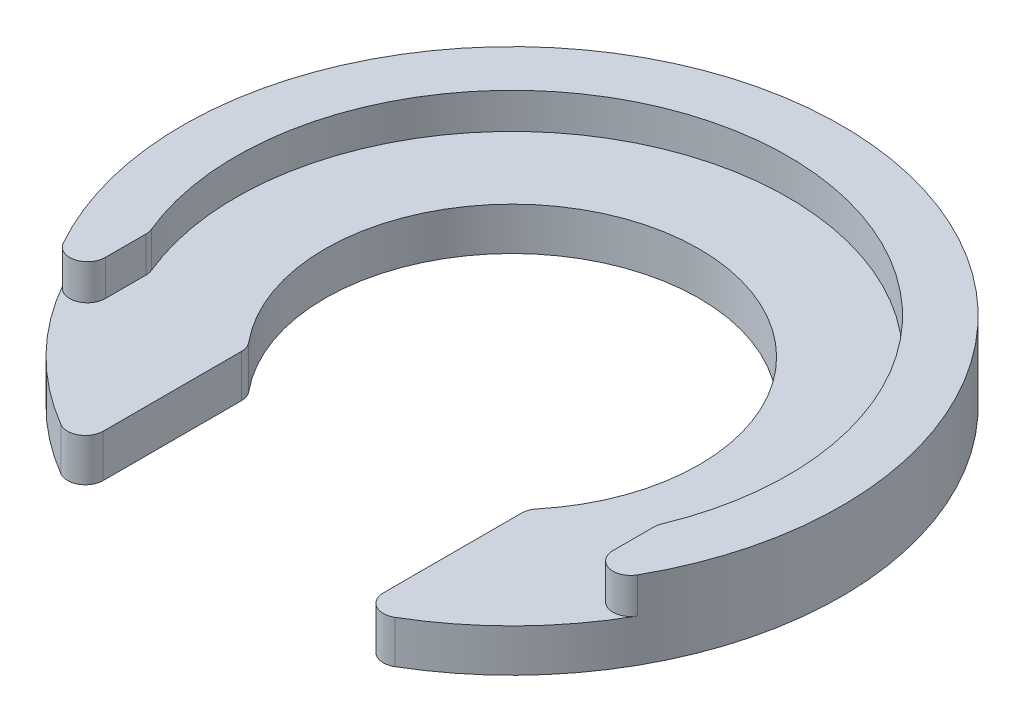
ISO-10303-21;
HEADER;
FILE_DESCRIPTION(('STEP AP214'),'2;1');
FILE_NAME('part.step','',(''),(''),'','','');
FILE_SCHEMA(('AUTOMOTIVE_DESIGN { 1 0 10303 214 1 1 1 1 }'));
ENDSEC;
DATA;
#1=APPLICATION_CONTEXT('core data for automotive mechanical design processes');
#2=APPLICATION_PROTOCOL_DEFINITION('international standard','automotive_design',2000,#1);
#3=PRODUCT_CONTEXT('',#1,'mechanical');
#4=PRODUCT('Part','Part','',(#3));
#5=PRODUCT_RELATED_PRODUCT_CATEGORY('part','',(#4));
#6=PRODUCT_DEFINITION_FORMATION('','',#4);
#7=PRODUCT_DEFINITION_CONTEXT('part definition',#1,'design');
#8=PRODUCT_DEFINITION('design','',#6,#7);
#9=PRODUCT_DEFINITION_SHAPE('','',#8);
#10=(LENGTH_UNIT() NAMED_UNIT(*) SI_UNIT(.MILLI.,.METRE.));
#11=(NAMED_UNIT(*) PLANE_ANGLE_UNIT() SI_UNIT($,.RADIAN.));
#12=(NAMED_UNIT(*) SI_UNIT($,.STERADIAN.) SOLID_ANGLE_UNIT());
#13=UNCERTAINTY_MEASURE_WITH_UNIT(LENGTH_MEASURE(1.E-05),#10,'distance_accuracy_value','');
#14=(GEOMETRIC_REPRESENTATION_CONTEXT(3) GLOBAL_UNCERTAINTY_ASSIGNED_CONTEXT((#13)) GLOBAL_UNIT_ASSIGNED_CONTEXT((#10,
#11,#12)) REPRESENTATION_CONTEXT('',''));
#15=CARTESIAN_POINT('',(0.,0.,0.));
#16=DIRECTION('',(0.,0.,1.));
#17=DIRECTION('',(1.,0.,0.));
#18=AXIS2_PLACEMENT_3D('',#15,#16,#17);
#19=CARTESIAN_POINT('',(0.,0.,0.));
#20=DIRECTION('',(0.,-1.,0.));
#21=DIRECTION('',(0.,0.,-1.));
#22=AXIS2_PLACEMENT_3D('',#19,#20,#21);
#23=CYLINDRICAL_SURFACE('',#22,18.5);
#24=CARTESIAN_POINT('',(0.,2.4,0.));
#25=DIRECTION('',(0.,1.,0.));
#26=DIRECTION('',(0.,0.,1.));
#27=AXIS2_PLACEMENT_3D('',#24,#25,#26);
#28=CIRCLE('',#27,18.5);
#29=CARTESIAN_POINT('',(9.36777121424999,2.4,15.9528951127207));
#30=VERTEX_POINT('',#29);
#31=CARTESIAN_POINT('',(16.1214285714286,2.4,9.07466477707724));
#32=VERTEX_POINT('',#31);
#33=EDGE_CURVE('E251',#30,#32,#28,.T.);
#34=ORIENTED_EDGE('',*,*,#33,.F.);
#35=DIRECTION('',(0.,-1.,0.));
#36=VECTOR('',#35,1.);
#37=CARTESIAN_POINT('',(9.36777121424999,0.,15.9528951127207));
#38=LINE('',#37,#36);
#39=CARTESIAN_POINT('',(9.36777121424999,0.,15.9528951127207));
#40=VERTEX_POINT('',#39);
#41=EDGE_CURVE('E217',#30,#40,#38,.T.);
#42=ORIENTED_EDGE('',*,*,#41,.T.);
#43=CARTESIAN_POINT('',(0.,0.,0.));
#44=DIRECTION('',(0.,-1.,0.));
#45=DIRECTION('',(0.,0.,-1.));
#46=AXIS2_PLACEMENT_3D('',#43,#44,#45);
#47=CIRCLE('',#46,18.5);
#48=CARTESIAN_POINT('',(-9.36777121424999,0.,15.9528951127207));
#49=VERTEX_POINT('',#48);
#50=EDGE_CURVE('E177',#49,#40,#47,.T.);
#51=ORIENTED_EDGE('',*,*,#50,.F.);
#52=DIRECTION('',(0.,-1.,0.));
#53=VECTOR('',#52,1.);
#54=CARTESIAN_POINT('',(-9.36777121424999,0.,15.9528951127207));
#55=LINE('',#54,#53);
#56=CARTESIAN_POINT('',(-9.36777121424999,2.4,15.9528951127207));
#57=VERTEX_POINT('',#56);
#58=EDGE_CURVE('E214',#49,#57,#55,.F.);
#59=ORIENTED_EDGE('',*,*,#58,.T.);
#60=CARTESIAN_POINT('',(-16.1214285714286,2.4,9.07466477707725));
#61=VERTEX_POINT('',#60);
#62=EDGE_CURVE('E313',#61,#57,#28,.T.);
#63=ORIENTED_EDGE('',*,*,#62,.F.);
#64=DIRECTION('',(0.,-1.,0.));
#65=VECTOR('',#64,1.);
#66=CARTESIAN_POINT('',(-16.1214285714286,0.,9.07466477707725));
#67=LINE('',#66,#65);
#68=CARTESIAN_POINT('',(-16.1214285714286,4.4,9.07466477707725));
#69=VERTEX_POINT('',#68);
#70=EDGE_CURVE('E209',#61,#69,#67,.F.);
#71=ORIENTED_EDGE('',*,*,#70,.T.);
#72=CARTESIAN_POINT('',(0.,4.4,0.));
#73=DIRECTION('',(0.,-1.,0.));
#74=DIRECTION('',(0.,0.,-1.));
#75=AXIS2_PLACEMENT_3D('',#72,#73,#74);
#76=CIRCLE('',#75,18.5);
#77=CARTESIAN_POINT('',(16.1214285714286,4.4,9.07466477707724));
#78=VERTEX_POINT('',#77);
#79=EDGE_CURVE('E324',#69,#78,#76,.T.);
#80=ORIENTED_EDGE('',*,*,#79,.T.);
#81=DIRECTION('',(0.,-1.,0.));
#82=VECTOR('',#81,1.);
#83=CARTESIAN_POINT('',(16.1214285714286,0.,9.07466477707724));
#84=LINE('',#83,#82);
#85=EDGE_CURVE('E211',#78,#32,#84,.T.);
#86=ORIENTED_EDGE('',*,*,#85,.T.);
#87=EDGE_LOOP('',(#34,#42,#51,#59,#63,#71,#80,#86));
#88=FACE_BOUND('',#87,.T.);
#89=ADVANCED_FACE('F33',(#88),#23,.T.);
#90=CARTESIAN_POINT('',(0.,0.,0.));
#91=DIRECTION('',(0.,-1.,0.));
#92=DIRECTION('',(0.,0.,-1.));
#93=AXIS2_PLACEMENT_3D('',#90,#91,#92);
#94=CYLINDRICAL_SURFACE('',#93,15.5);
#95=CARTESIAN_POINT('',(0.,4.4,0.));
#96=DIRECTION('',(0.,-1.,0.));
#97=DIRECTION('',(0.,0.,-1.));
#98=AXIS2_PLACEMENT_3D('',#95,#96,#97);
#99=CIRCLE('',#98,15.5);
#100=CARTESIAN_POINT('',(-14.3257575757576,4.4,5.91799542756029));
#101=VERTEX_POINT('',#100);
#102=CARTESIAN_POINT('',(14.3257575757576,4.4,5.91799542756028));
#103=VERTEX_POINT('',#102);
#104=EDGE_CURVE('E327',#101,#103,#99,.T.);
#105=ORIENTED_EDGE('',*,*,#104,.F.);
#106=DIRECTION('',(0.,-1.,0.));
#107=VECTOR('',#106,1.);
#108=CARTESIAN_POINT('',(-14.3257575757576,0.,5.91799542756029));
#109=LINE('',#108,#107);
#110=CARTESIAN_POINT('',(-14.3257575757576,2.4,5.91799542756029));
#111=VERTEX_POINT('',#110);
#112=EDGE_CURVE('E234',#101,#111,#109,.T.);
#113=ORIENTED_EDGE('',*,*,#112,.T.);
#114=CARTESIAN_POINT('',(0.,2.4,0.));
#115=DIRECTION('',(0.,-1.,0.));
#116=DIRECTION('',(0.,0.,-1.));
#117=AXIS2_PLACEMENT_3D('',#114,#115,#116);
#118=CIRCLE('',#117,15.5);
#119=CARTESIAN_POINT('',(14.3257575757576,2.4,5.91799542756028));
#120=VERTEX_POINT('',#119);
#121=EDGE_CURVE('E182',#111,#120,#118,.T.);
#122=ORIENTED_EDGE('',*,*,#121,.T.);
#123=DIRECTION('',(0.,-1.,0.));
#124=VECTOR('',#123,1.);
#125=CARTESIAN_POINT('',(14.3257575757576,0.,5.91799542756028));
#126=LINE('',#125,#124);
#127=EDGE_CURVE('E232',#120,#103,#126,.F.);
#128=ORIENTED_EDGE('',*,*,#127,.T.);
#129=EDGE_LOOP('',(#105,#113,#122,#128));
#130=FACE_BOUND('',#129,.T.);
#131=ADVANCED_FACE('F269',(#130),#94,.F.);
#132=CARTESIAN_POINT('',(-15.5,4.4,0.));
#133=DIRECTION('',(0.,-1.,0.));
#134=DIRECTION('',(0.,0.,-1.));
#135=AXIS2_PLACEMENT_3D('',#132,#133,#134);
#136=PLANE('',#135);
#137=DIRECTION('',(0.,0.,1.));
#138=VECTOR('',#137,1.);
#139=CARTESIAN_POINT('',(-14.25,4.4,0.));
#140=LINE('',#139,#138);
#141=CARTESIAN_POINT('',(-14.25,4.4,6.29980158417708));
#142=VERTEX_POINT('',#141);
#143=CARTESIAN_POINT('',(-14.25,4.4,8.58414235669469));
#144=VERTEX_POINT('',#143);
#145=EDGE_CURVE('E172',#142,#144,#140,.T.);
#146=ORIENTED_EDGE('',*,*,#145,.F.);
#147=CARTESIAN_POINT('',(-15.25,4.4,6.29980158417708));
#148=DIRECTION('',(0.,-1.,0.));
#149=DIRECTION('',(0.,0.,-1.));
#150=AXIS2_PLACEMENT_3D('',#147,#148,#149);
#151=CIRCLE('',#150,1.);
#152=EDGE_CURVE('E230',#142,#101,#151,.F.);
#153=ORIENTED_EDGE('',*,*,#152,.T.);
#154=ORIENTED_EDGE('',*,*,#104,.T.);
#155=CARTESIAN_POINT('',(15.25,4.4,6.29980158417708));
#156=DIRECTION('',(0.,-1.,0.));
#157=DIRECTION('',(0.,0.,-1.));
#158=AXIS2_PLACEMENT_3D('',#155,#156,#157);
#159=CIRCLE('',#158,1.);
#160=CARTESIAN_POINT('',(14.25,4.4,6.29980158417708));
#161=VERTEX_POINT('',#160);
#162=EDGE_CURVE('E48',#103,#161,#159,.F.);
#163=ORIENTED_EDGE('',*,*,#162,.T.);
#164=DIRECTION('',(0.,0.,-1.));
#165=VECTOR('',#164,1.);
#166=CARTESIAN_POINT('',(14.25,4.4,0.));
#167=LINE('',#166,#165);
#168=CARTESIAN_POINT('',(14.25,4.4,8.58414235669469));
#169=VERTEX_POINT('',#168);
#170=EDGE_CURVE('E180',#169,#161,#167,.T.);
#171=ORIENTED_EDGE('',*,*,#170,.F.);
#172=CARTESIAN_POINT('',(15.25,4.4,8.58414235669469));
#173=DIRECTION('',(0.,-1.,0.));
#174=DIRECTION('',(0.,0.,-1.));
#175=AXIS2_PLACEMENT_3D('',#172,#173,#174);
#176=CIRCLE('',#175,1.);
#177=EDGE_CURVE('E56',#169,#78,#176,.F.);
#178=ORIENTED_EDGE('',*,*,#177,.T.);
#179=ORIENTED_EDGE('',*,*,#79,.F.);
#180=CARTESIAN_POINT('',(-15.25,4.4,8.58414235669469));
#181=DIRECTION('',(0.,-1.,0.));
#182=DIRECTION('',(0.,0.,-1.));
#183=AXIS2_PLACEMENT_3D('',#180,#181,#182);
#184=CIRCLE('',#183,1.);
#185=EDGE_CURVE('E226',#69,#144,#184,.F.);
#186=ORIENTED_EDGE('',*,*,#185,.T.);
#187=EDGE_LOOP('',(#146,#153,#154,#163,#171,#178,#179,#186));
#188=FACE_BOUND('',#187,.T.);
#189=ADVANCED_FACE('F275',(#188),#136,.F.);
#190=CARTESIAN_POINT('',(-7.86140520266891,0.,0.));
#191=DIRECTION('',(-1.,0.,0.));
#192=DIRECTION('',(0.,0.,1.));
#193=AXIS2_PLACEMENT_3D('',#190,#191,#192);
#194=PLANE('',#193);
#195=DIRECTION('',(0.,0.,1.));
#196=VECTOR('',#195,1.);
#197=CARTESIAN_POINT('',(-7.86140520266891,0.,0.));
#198=LINE('',#197,#196);
#199=CARTESIAN_POINT('',(-7.86140520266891,0.,7.32976792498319));
#200=VERTEX_POINT('',#199);
#201=CARTESIAN_POINT('',(-7.86140520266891,0.,15.0905764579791));
#202=VERTEX_POINT('',#201);
#203=EDGE_CURVE('E314',#200,#202,#198,.T.);
#204=ORIENTED_EDGE('',*,*,#203,.F.);
#205=DIRECTION('',(0.,-1.,0.));
#206=VECTOR('',#205,1.);
#207=CARTESIAN_POINT('',(-7.86140520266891,0.,7.32976792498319));
#208=LINE('',#207,#206);
#209=CARTESIAN_POINT('',(-7.86140520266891,2.4,7.32976792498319));
#210=VERTEX_POINT('',#209);
#211=EDGE_CURVE('E154',#200,#210,#208,.F.);
#212=ORIENTED_EDGE('',*,*,#211,.T.);
#213=DIRECTION('',(0.,0.,-1.));
#214=VECTOR('',#213,1.);
#215=CARTESIAN_POINT('',(-7.86140520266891,2.4,0.));
#216=LINE('',#215,#214);
#217=CARTESIAN_POINT('',(-7.86140520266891,2.4,15.0905764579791));
#218=VERTEX_POINT('',#217);
#219=EDGE_CURVE('E318',#218,#210,#216,.T.);
#220=ORIENTED_EDGE('',*,*,#219,.F.);
#221=DIRECTION('',(0.,-1.,0.));
#222=VECTOR('',#221,1.);
#223=CARTESIAN_POINT('',(-7.86140520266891,0.,15.0905764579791));
#224=LINE('',#223,#222);
#225=EDGE_CURVE('E206',#218,#202,#224,.T.);
#226=ORIENTED_EDGE('',*,*,#225,.T.);
#227=EDGE_LOOP('',(#204,#212,#220,#226));
#228=FACE_BOUND('',#227,.T.);
#229=ADVANCED_FACE('F340',(#228),#194,.F.);
#230=CARTESIAN_POINT('',(7.86140520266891,0.,0.));
#231=DIRECTION('',(1.,0.,0.));
#232=DIRECTION('',(0.,0.,-1.));
#233=AXIS2_PLACEMENT_3D('',#230,#231,#232);
#234=PLANE('',#233);
#235=DIRECTION('',(0.,0.,1.));
#236=VECTOR('',#235,1.);
#237=CARTESIAN_POINT('',(7.86140520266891,2.4,0.));
#238=LINE('',#237,#236);
#239=CARTESIAN_POINT('',(7.86140520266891,2.4,7.32976792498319));
#240=VERTEX_POINT('',#239);
#241=CARTESIAN_POINT('',(7.86140520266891,2.4,15.0905764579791));
#242=VERTEX_POINT('',#241);
#243=EDGE_CURVE('E321',#240,#242,#238,.T.);
#244=ORIENTED_EDGE('',*,*,#243,.F.);
#245=DIRECTION('',(0.,-1.,0.));
#246=VECTOR('',#245,1.);
#247=CARTESIAN_POINT('',(7.86140520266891,0.,7.32976792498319));
#248=LINE('',#247,#246);
#249=CARTESIAN_POINT('',(7.86140520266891,0.,7.32976792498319));
#250=VERTEX_POINT('',#249);
#251=EDGE_CURVE('E200',#240,#250,#248,.T.);
#252=ORIENTED_EDGE('',*,*,#251,.T.);
#253=DIRECTION('',(0.,0.,-1.));
#254=VECTOR('',#253,1.);
#255=CARTESIAN_POINT('',(7.86140520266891,0.,0.));
#256=LINE('',#255,#254);
#257=CARTESIAN_POINT('',(7.86140520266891,0.,15.0905764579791));
#258=VERTEX_POINT('',#257);
#259=EDGE_CURVE('E316',#258,#250,#256,.T.);
#260=ORIENTED_EDGE('',*,*,#259,.F.);
#261=DIRECTION('',(0.,-1.,0.));
#262=VECTOR('',#261,1.);
#263=CARTESIAN_POINT('',(7.86140520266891,0.,15.0905764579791));
#264=LINE('',#263,#262);
#265=EDGE_CURVE('E198',#258,#242,#264,.F.);
#266=ORIENTED_EDGE('',*,*,#265,.T.);
#267=EDGE_LOOP('',(#244,#252,#260,#266));
#268=FACE_BOUND('',#267,.T.);
#269=ADVANCED_FACE('F346',(#268),#234,.F.);
#270=CARTESIAN_POINT('',(-18.5,0.,0.));
#271=DIRECTION('',(0.,1.,0.));
#272=DIRECTION('',(0.,0.,1.));
#273=AXIS2_PLACEMENT_3D('',#270,#271,#272);
#274=PLANE('',#273);
#275=ORIENTED_EDGE('',*,*,#259,.T.);
#276=CARTESIAN_POINT('',(8.86140520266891,0.,7.32976792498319));
#277=DIRECTION('',(0.,1.,0.));
#278=DIRECTION('',(0.,0.,1.));
#279=AXIS2_PLACEMENT_3D('',#276,#277,#278);
#280=CIRCLE('',#279,1.);
#281=CARTESIAN_POINT('',(8.09084822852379,0.,6.6923968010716));
#282=VERTEX_POINT('',#281);
#283=EDGE_CURVE('E159',#250,#282,#280,.F.);
#284=ORIENTED_EDGE('',*,*,#283,.T.);
#285=CARTESIAN_POINT('',(0.,0.,0.));
#286=DIRECTION('',(0.,-1.,0.));
#287=DIRECTION('',(0.,0.,-1.));
#288=AXIS2_PLACEMENT_3D('',#285,#286,#287);
#289=CIRCLE('',#288,10.5);
#290=CARTESIAN_POINT('',(-8.09084822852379,0.,6.6923968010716));
#291=VERTEX_POINT('',#290);
#292=EDGE_CURVE('E167',#291,#282,#289,.T.);
#293=ORIENTED_EDGE('',*,*,#292,.F.);
#294=CARTESIAN_POINT('',(-8.86140520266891,0.,7.32976792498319));
#295=DIRECTION('',(0.,1.,0.));
#296=DIRECTION('',(0.,0.,1.));
#297=AXIS2_PLACEMENT_3D('',#294,#295,#296);
#298=CIRCLE('',#297,1.);
#299=EDGE_CURVE('E149',#291,#200,#298,.F.);
#300=ORIENTED_EDGE('',*,*,#299,.T.);
#301=ORIENTED_EDGE('',*,*,#203,.T.);
#302=CARTESIAN_POINT('',(-8.86140520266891,0.,15.0905764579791));
#303=DIRECTION('',(0.,1.,0.));
#304=DIRECTION('',(0.,0.,1.));
#305=AXIS2_PLACEMENT_3D('',#302,#303,#304);
#306=CIRCLE('',#305,1.);
#307=EDGE_CURVE('E202',#202,#49,#306,.F.);
#308=ORIENTED_EDGE('',*,*,#307,.T.);
#309=ORIENTED_EDGE('',*,*,#50,.T.);
#310=CARTESIAN_POINT('',(8.86140520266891,0.,15.0905764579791));
#311=DIRECTION('',(0.,1.,0.));
#312=DIRECTION('',(0.,0.,1.));
#313=AXIS2_PLACEMENT_3D('',#310,#311,#312);
#314=CIRCLE('',#313,1.);
#315=EDGE_CURVE('E160',#40,#258,#314,.F.);
#316=ORIENTED_EDGE('',*,*,#315,.T.);
#317=EDGE_LOOP('',(#275,#284,#293,#300,#301,#308,#309,#316));
#318=FACE_BOUND('',#317,.T.);
#319=ADVANCED_FACE('F175',(#318),#274,.F.);
#320=CARTESIAN_POINT('',(0.,0.,0.));
#321=DIRECTION('',(0.,-1.,0.));
#322=DIRECTION('',(0.,0.,-1.));
#323=AXIS2_PLACEMENT_3D('',#320,#321,#322);
#324=CYLINDRICAL_SURFACE('',#323,10.5);
#325=ORIENTED_EDGE('',*,*,#292,.T.);
#326=DIRECTION('',(0.,-1.,0.));
#327=VECTOR('',#326,1.);
#328=CARTESIAN_POINT('',(8.09084822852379,0.,6.6923968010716));
#329=LINE('',#328,#327);
#330=CARTESIAN_POINT('',(8.09084822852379,2.4,6.6923968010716));
#331=VERTEX_POINT('',#330);
#332=EDGE_CURVE('E171',#282,#331,#329,.F.);
#333=ORIENTED_EDGE('',*,*,#332,.T.);
#334=CARTESIAN_POINT('',(0.,2.4,0.));
#335=DIRECTION('',(0.,-1.,0.));
#336=DIRECTION('',(0.,0.,-1.));
#337=AXIS2_PLACEMENT_3D('',#334,#335,#336);
#338=CIRCLE('',#337,10.5);
#339=CARTESIAN_POINT('',(-8.09084822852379,2.4,6.6923968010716));
#340=VERTEX_POINT('',#339);
#341=EDGE_CURVE('E170',#340,#331,#338,.T.);
#342=ORIENTED_EDGE('',*,*,#341,.F.);
#343=DIRECTION('',(0.,-1.,0.));
#344=VECTOR('',#343,1.);
#345=CARTESIAN_POINT('',(-8.09084822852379,0.,6.6923968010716));
#346=LINE('',#345,#344);
#347=EDGE_CURVE('E153',#340,#291,#346,.T.);
#348=ORIENTED_EDGE('',*,*,#347,.T.);
#349=EDGE_LOOP('',(#325,#333,#342,#348));
#350=FACE_BOUND('',#349,.T.);
#351=ADVANCED_FACE('F165',(#350),#324,.F.);
#352=CARTESIAN_POINT('',(-10.5,2.4,0.));
#353=DIRECTION('',(0.,-1.,0.));
#354=DIRECTION('',(0.,0.,-1.));
#355=AXIS2_PLACEMENT_3D('',#352,#353,#354);
#356=PLANE('',#355);
#357=ORIENTED_EDGE('',*,*,#341,.T.);
#358=CARTESIAN_POINT('',(8.86140520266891,2.4,7.32976792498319));
#359=DIRECTION('',(0.,-1.,0.));
#360=DIRECTION('',(0.,0.,-1.));
#361=AXIS2_PLACEMENT_3D('',#358,#359,#360);
#362=CIRCLE('',#361,1.);
#363=EDGE_CURVE('E196',#331,#240,#362,.F.);
#364=ORIENTED_EDGE('',*,*,#363,.T.);
#365=ORIENTED_EDGE('',*,*,#243,.T.);
#366=CARTESIAN_POINT('',(8.86140520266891,2.4,15.0905764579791));
#367=DIRECTION('',(0.,-1.,0.));
#368=DIRECTION('',(0.,0.,-1.));
#369=AXIS2_PLACEMENT_3D('',#366,#367,#368);
#370=CIRCLE('',#369,1.);
#371=EDGE_CURVE('E192',#242,#30,#370,.F.);
#372=ORIENTED_EDGE('',*,*,#371,.T.);
#373=ORIENTED_EDGE('',*,*,#33,.T.);
#374=CARTESIAN_POINT('',(15.25,2.4,8.58414235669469));
#375=DIRECTION('',(0.,-1.,0.));
#376=DIRECTION('',(0.,0.,-1.));
#377=AXIS2_PLACEMENT_3D('',#374,#375,#376);
#378=CIRCLE('',#377,1.);
#379=CARTESIAN_POINT('',(14.25,2.4,8.58414235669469));
#380=VERTEX_POINT('',#379);
#381=EDGE_CURVE('E41',#32,#380,#378,.T.);
#382=ORIENTED_EDGE('',*,*,#381,.T.);
#383=DIRECTION('',(0.,0.,-1.));
#384=VECTOR('',#383,1.);
#385=CARTESIAN_POINT('',(14.25,2.4,0.));
#386=LINE('',#385,#384);
#387=CARTESIAN_POINT('',(14.25,2.4,6.29980158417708));
#388=VERTEX_POINT('',#387);
#389=EDGE_CURVE('E249',#380,#388,#386,.T.);
#390=ORIENTED_EDGE('',*,*,#389,.T.);
#391=CARTESIAN_POINT('',(15.25,2.4,6.29980158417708));
#392=DIRECTION('',(0.,-1.,0.));
#393=DIRECTION('',(0.,0.,-1.));
#394=AXIS2_PLACEMENT_3D('',#391,#392,#393);
#395=CIRCLE('',#394,1.);
#396=EDGE_CURVE('E243',#388,#120,#395,.T.);
#397=ORIENTED_EDGE('',*,*,#396,.T.);
#398=ORIENTED_EDGE('',*,*,#121,.F.);
#399=CARTESIAN_POINT('',(-15.25,2.4,6.29980158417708));
#400=DIRECTION('',(0.,-1.,0.));
#401=DIRECTION('',(0.,0.,-1.));
#402=AXIS2_PLACEMENT_3D('',#399,#400,#401);
#403=CIRCLE('',#402,1.);
#404=CARTESIAN_POINT('',(-14.25,2.4,6.29980158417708));
#405=VERTEX_POINT('',#404);
#406=EDGE_CURVE('E241',#111,#405,#403,.T.);
#407=ORIENTED_EDGE('',*,*,#406,.T.);
#408=DIRECTION('',(0.,0.,1.));
#409=VECTOR('',#408,1.);
#410=CARTESIAN_POINT('',(-14.25,2.4,0.));
#411=LINE('',#410,#409);
#412=CARTESIAN_POINT('',(-14.25,2.4,8.58414235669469));
#413=VERTEX_POINT('',#412);
#414=EDGE_CURVE('E255',#405,#413,#411,.T.);
#415=ORIENTED_EDGE('',*,*,#414,.T.);
#416=CARTESIAN_POINT('',(-15.25,2.4,8.58414235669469));
#417=DIRECTION('',(0.,-1.,0.));
#418=DIRECTION('',(0.,0.,-1.));
#419=AXIS2_PLACEMENT_3D('',#416,#417,#418);
#420=CIRCLE('',#419,1.);
#421=EDGE_CURVE('E11',#413,#61,#420,.T.);
#422=ORIENTED_EDGE('',*,*,#421,.T.);
#423=ORIENTED_EDGE('',*,*,#62,.T.);
#424=CARTESIAN_POINT('',(-8.86140520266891,2.4,15.0905764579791));
#425=DIRECTION('',(0.,-1.,0.));
#426=DIRECTION('',(0.,0.,-1.));
#427=AXIS2_PLACEMENT_3D('',#424,#425,#426);
#428=CIRCLE('',#427,1.);
#429=EDGE_CURVE('E190',#57,#218,#428,.F.);
#430=ORIENTED_EDGE('',*,*,#429,.T.);
#431=ORIENTED_EDGE('',*,*,#219,.T.);
#432=CARTESIAN_POINT('',(-8.86140520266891,2.4,7.32976792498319));
#433=DIRECTION('',(0.,-1.,0.));
#434=DIRECTION('',(0.,0.,-1.));
#435=AXIS2_PLACEMENT_3D('',#432,#433,#434);
#436=CIRCLE('',#435,1.);
#437=EDGE_CURVE('E194',#210,#340,#436,.F.);
#438=ORIENTED_EDGE('',*,*,#437,.T.);
#439=EDGE_LOOP('',(#357,#364,#365,#372,#373,#382,#390,#397,#398,#407,#415,#422,#423,#430,#431,#438));
#440=FACE_BOUND('',#439,.T.);
#441=ADVANCED_FACE('F248',(#440),#356,.F.);
#442=CARTESIAN_POINT('',(14.25,12.4,0.));
#443=DIRECTION('',(-1.,0.,0.));
#444=DIRECTION('',(0.,0.,1.));
#445=AXIS2_PLACEMENT_3D('',#442,#443,#444);
#446=PLANE('',#445);
#447=ORIENTED_EDGE('',*,*,#170,.T.);
#448=DIRECTION('',(0.,1.,0.));
#449=VECTOR('',#448,1.);
#450=CARTESIAN_POINT('',(14.25,2.4,6.29980158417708));
#451=LINE('',#450,#449);
#452=EDGE_CURVE('E238',#161,#388,#451,.F.);
#453=ORIENTED_EDGE('',*,*,#452,.T.);
#454=ORIENTED_EDGE('',*,*,#389,.F.);
#455=DIRECTION('',(0.,1.,0.));
#456=VECTOR('',#455,1.);
#457=CARTESIAN_POINT('',(14.25,4.4,8.58414235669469));
#458=LINE('',#457,#456);
#459=EDGE_CURVE('E236',#380,#169,#458,.T.);
#460=ORIENTED_EDGE('',*,*,#459,.T.);
#461=EDGE_LOOP('',(#447,#453,#454,#460));
#462=FACE_BOUND('',#461,.T.);
#463=ADVANCED_FACE('F253',(#462),#446,.T.);
#464=CARTESIAN_POINT('',(-14.25,12.4,0.));
#465=DIRECTION('',(1.,0.,0.));
#466=DIRECTION('',(0.,0.,-1.));
#467=AXIS2_PLACEMENT_3D('',#464,#465,#466);
#468=PLANE('',#467);
#469=ORIENTED_EDGE('',*,*,#414,.F.);
#470=DIRECTION('',(0.,1.,0.));
#471=VECTOR('',#470,1.);
#472=CARTESIAN_POINT('',(-14.25,4.4,6.29980158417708));
#473=LINE('',#472,#471);
#474=EDGE_CURVE('E223',#405,#142,#473,.T.);
#475=ORIENTED_EDGE('',*,*,#474,.T.);
#476=ORIENTED_EDGE('',*,*,#145,.T.);
#477=DIRECTION('',(0.,1.,0.));
#478=VECTOR('',#477,1.);
#479=CARTESIAN_POINT('',(-14.25,2.4,8.58414235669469));
#480=LINE('',#479,#478);
#481=EDGE_CURVE('E220',#144,#413,#480,.F.);
#482=ORIENTED_EDGE('',*,*,#481,.T.);
#483=EDGE_LOOP('',(#469,#475,#476,#482));
#484=FACE_BOUND('',#483,.T.);
#485=ADVANCED_FACE('F284',(#484),#468,.T.);
#486=CARTESIAN_POINT('',(8.86140520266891,0.,7.32976792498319));
#487=DIRECTION('',(0.,-1.,0.));
#488=DIRECTION('',(0.,0.,-1.));
#489=AXIS2_PLACEMENT_3D('',#486,#487,#488);
#490=CYLINDRICAL_SURFACE('',#489,1.);
#491=ORIENTED_EDGE('',*,*,#283,.F.);
#492=ORIENTED_EDGE('',*,*,#251,.F.);
#493=ORIENTED_EDGE('',*,*,#363,.F.);
#494=ORIENTED_EDGE('',*,*,#332,.F.);
#495=EDGE_LOOP('',(#491,#492,#493,#494));
#496=FACE_BOUND('',#495,.T.);
#497=ADVANCED_FACE('F281',(#496),#490,.T.);
#498=CARTESIAN_POINT('',(-8.86140520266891,0.,7.32976792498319));
#499=DIRECTION('',(0.,-1.,0.));
#500=DIRECTION('',(0.,0.,-1.));
#501=AXIS2_PLACEMENT_3D('',#498,#499,#500);
#502=CYLINDRICAL_SURFACE('',#501,1.);
#503=ORIENTED_EDGE('',*,*,#437,.F.);
#504=ORIENTED_EDGE('',*,*,#211,.F.);
#505=ORIENTED_EDGE('',*,*,#299,.F.);
#506=ORIENTED_EDGE('',*,*,#347,.F.);
#507=EDGE_LOOP('',(#503,#504,#505,#506));
#508=FACE_BOUND('',#507,.T.);
#509=ADVANCED_FACE('F152',(#508),#502,.T.);
#510=CARTESIAN_POINT('',(8.86140520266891,0.,15.0905764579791));
#511=DIRECTION('',(0.,-1.,0.));
#512=DIRECTION('',(0.,0.,-1.));
#513=AXIS2_PLACEMENT_3D('',#510,#511,#512);
#514=CYLINDRICAL_SURFACE('',#513,1.);
#515=ORIENTED_EDGE('',*,*,#371,.F.);
#516=ORIENTED_EDGE('',*,*,#265,.F.);
#517=ORIENTED_EDGE('',*,*,#315,.F.);
#518=ORIENTED_EDGE('',*,*,#41,.F.);
#519=EDGE_LOOP('',(#515,#516,#517,#518));
#520=FACE_BOUND('',#519,.T.);
#521=ADVANCED_FACE('F288',(#520),#514,.T.);
#522=CARTESIAN_POINT('',(-8.86140520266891,0.,15.0905764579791));
#523=DIRECTION('',(0.,-1.,0.));
#524=DIRECTION('',(0.,0.,-1.));
#525=AXIS2_PLACEMENT_3D('',#522,#523,#524);
#526=CYLINDRICAL_SURFACE('',#525,1.);
#527=ORIENTED_EDGE('',*,*,#307,.F.);
#528=ORIENTED_EDGE('',*,*,#225,.F.);
#529=ORIENTED_EDGE('',*,*,#429,.F.);
#530=ORIENTED_EDGE('',*,*,#58,.F.);
#531=EDGE_LOOP('',(#527,#528,#529,#530));
#532=FACE_BOUND('',#531,.T.);
#533=ADVANCED_FACE('F291',(#532),#526,.T.);
#534=CARTESIAN_POINT('',(-15.25,0.,6.29980158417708));
#535=DIRECTION('',(0.,-1.,0.));
#536=DIRECTION('',(0.,0.,-1.));
#537=AXIS2_PLACEMENT_3D('',#534,#535,#536);
#538=CYLINDRICAL_SURFACE('',#537,1.);
#539=ORIENTED_EDGE('',*,*,#406,.F.);
#540=ORIENTED_EDGE('',*,*,#112,.F.);
#541=ORIENTED_EDGE('',*,*,#152,.F.);
#542=ORIENTED_EDGE('',*,*,#474,.F.);
#543=EDGE_LOOP('',(#539,#540,#541,#542));
#544=FACE_BOUND('',#543,.T.);
#545=ADVANCED_FACE('F265',(#544),#538,.T.);
#546=CARTESIAN_POINT('',(15.25,0.,6.29980158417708));
#547=DIRECTION('',(0.,-1.,0.));
#548=DIRECTION('',(0.,0.,-1.));
#549=AXIS2_PLACEMENT_3D('',#546,#547,#548);
#550=CYLINDRICAL_SURFACE('',#549,1.);
#551=ORIENTED_EDGE('',*,*,#162,.F.);
#552=ORIENTED_EDGE('',*,*,#127,.F.);
#553=ORIENTED_EDGE('',*,*,#396,.F.);
#554=ORIENTED_EDGE('',*,*,#452,.F.);
#555=EDGE_LOOP('',(#551,#552,#553,#554));
#556=FACE_BOUND('',#555,.T.);
#557=ADVANCED_FACE('F259',(#556),#550,.T.);
#558=CARTESIAN_POINT('',(15.25,0.,8.58414235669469));
#559=DIRECTION('',(0.,-1.,0.));
#560=DIRECTION('',(0.,0.,-1.));
#561=AXIS2_PLACEMENT_3D('',#558,#559,#560);
#562=CYLINDRICAL_SURFACE('',#561,1.);
#563=ORIENTED_EDGE('',*,*,#381,.F.);
#564=ORIENTED_EDGE('',*,*,#85,.F.);
#565=ORIENTED_EDGE('',*,*,#177,.F.);
#566=ORIENTED_EDGE('',*,*,#459,.F.);
#567=EDGE_LOOP('',(#563,#564,#565,#566));
#568=FACE_BOUND('',#567,.T.);
#569=ADVANCED_FACE('F257',(#568),#562,.T.);
#570=CARTESIAN_POINT('',(-15.25,0.,8.58414235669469));
#571=DIRECTION('',(0.,-1.,0.));
#572=DIRECTION('',(0.,0.,-1.));
#573=AXIS2_PLACEMENT_3D('',#570,#571,#572);
#574=CYLINDRICAL_SURFACE('',#573,1.);
#575=ORIENTED_EDGE('',*,*,#185,.F.);
#576=ORIENTED_EDGE('',*,*,#70,.F.);
#577=ORIENTED_EDGE('',*,*,#421,.F.);
#578=ORIENTED_EDGE('',*,*,#481,.F.);
#579=EDGE_LOOP('',(#575,#576,#577,#578));
#580=FACE_BOUND('',#579,.T.);
#581=ADVANCED_FACE('F35',(#580),#574,.T.);
#582=CLOSED_SHELL('',(#89,#131,#189,#229,#269,#319,#351,#441,#463,#485,#497,#509,#521,#533,#545,
#557,#569,#581));
#583=MANIFOLD_SOLID_BREP('B2',#582);
#584=ADVANCED_BREP_SHAPE_REPRESENTATION('',(#18,#583),#14);
#585=SHAPE_DEFINITION_REPRESENTATION(#9,#584);
ENDSEC;
END-ISO-10303-21;
